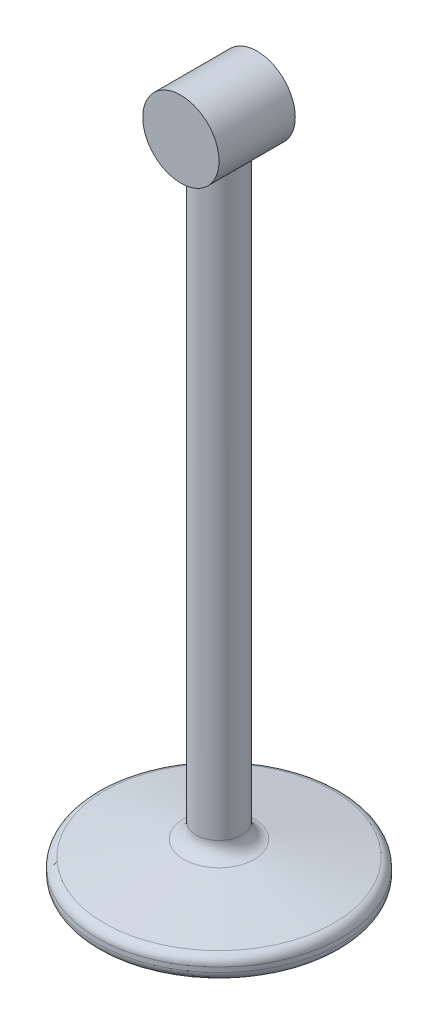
ISO-10303-21;
HEADER;
FILE_DESCRIPTION(('STEP AP214'),'2;1');
FILE_NAME('part.step','',(''),(''),'','','');
FILE_SCHEMA(('AUTOMOTIVE_DESIGN { 1 0 10303 214 1 1 1 1 }'));
ENDSEC;
DATA;
#1=APPLICATION_CONTEXT('core data for automotive mechanical design processes');
#2=APPLICATION_PROTOCOL_DEFINITION('international standard','automotive_design',2000,#1);
#3=PRODUCT_CONTEXT('',#1,'mechanical');
#4=PRODUCT('Part','Part','',(#3));
#5=PRODUCT_RELATED_PRODUCT_CATEGORY('part','',(#4));
#6=PRODUCT_DEFINITION_FORMATION('','',#4);
#7=PRODUCT_DEFINITION_CONTEXT('part definition',#1,'design');
#8=PRODUCT_DEFINITION('design','',#6,#7);
#9=PRODUCT_DEFINITION_SHAPE('','',#8);
#10=(LENGTH_UNIT() NAMED_UNIT(*) SI_UNIT(.MILLI.,.METRE.));
#11=(NAMED_UNIT(*) PLANE_ANGLE_UNIT() SI_UNIT($,.RADIAN.));
#12=(NAMED_UNIT(*) SI_UNIT($,.STERADIAN.) SOLID_ANGLE_UNIT());
#13=UNCERTAINTY_MEASURE_WITH_UNIT(LENGTH_MEASURE(1.E-05),#10,'distance_accuracy_value','');
#14=(GEOMETRIC_REPRESENTATION_CONTEXT(3) GLOBAL_UNCERTAINTY_ASSIGNED_CONTEXT((#13)) GLOBAL_UNIT_ASSIGNED_CONTEXT((#10,
#11,#12)) REPRESENTATION_CONTEXT('',''));
#15=CARTESIAN_POINT('',(0.,0.,0.));
#16=DIRECTION('',(0.,0.,1.));
#17=DIRECTION('',(1.,0.,0.));
#18=AXIS2_PLACEMENT_3D('',#15,#16,#17);
#19=CARTESIAN_POINT('',(0.,50.8,-3.175));
#20=DIRECTION('',(0.,0.,1.));
#21=DIRECTION('',(1.,0.,0.));
#22=AXIS2_PLACEMENT_3D('',#19,#20,#21);
#23=CYLINDRICAL_SURFACE('',#22,3.175);
#24=CARTESIAN_POINT('',(0.,50.8,3.175));
#25=DIRECTION('',(0.,0.,1.));
#26=DIRECTION('',(1.,0.,0.));
#27=AXIS2_PLACEMENT_3D('',#24,#25,#26);
#28=CIRCLE('',#27,3.175);
#29=CARTESIAN_POINT('',(3.175,50.8,3.175));
#30=VERTEX_POINT('',#29);
#31=EDGE_CURVE('E47',#30,#30,#28,.T.);
#32=ORIENTED_EDGE('',*,*,#31,.F.);
#33=EDGE_LOOP('',(#32));
#34=FACE_BOUND('',#33,.T.);
#35=CARTESIAN_POINT('',(0.,50.8,-3.175));
#36=DIRECTION('',(0.,0.,1.));
#37=DIRECTION('',(1.,0.,0.));
#38=AXIS2_PLACEMENT_3D('',#35,#36,#37);
#39=CIRCLE('',#38,3.175);
#40=CARTESIAN_POINT('',(3.175,50.8,-3.175));
#41=VERTEX_POINT('',#40);
#42=EDGE_CURVE('E43',#41,#41,#39,.T.);
#43=ORIENTED_EDGE('',*,*,#42,.T.);
#44=EDGE_LOOP('',(#43));
#45=FACE_BOUND('',#44,.T.);
#46=CARTESIAN_POINT('',(0.,47.625,-1.905));
#47=CARTESIAN_POINT('',(0.0974450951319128,47.6250054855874,-1.90499395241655));
#48=CARTESIAN_POINT('',(0.195049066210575,47.6295353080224,-1.89747035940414));
#49=CARTESIAN_POINT('',(0.387319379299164,47.6472260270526,-1.86775834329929));
#50=CARTESIAN_POINT('',(0.481977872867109,47.6604082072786,-1.84553375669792));
#51=CARTESIAN_POINT('',(0.665164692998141,47.6940682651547,-1.78766926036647));
#52=CARTESIAN_POINT('',(0.753720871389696,47.7145099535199,-1.75209584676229));
#53=CARTESIAN_POINT('',(0.923328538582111,47.7609488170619,-1.66895739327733));
#54=CARTESIAN_POINT('',(1.00438188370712,47.7869446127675,-1.62139533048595));
#55=CARTESIAN_POINT('',(1.16370007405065,47.8446419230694,-1.51158596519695));
#56=CARTESIAN_POINT('',(1.24127770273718,47.8766277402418,-1.44849380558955));
#57=CARTESIAN_POINT('',(1.3854210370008,47.9421134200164,-1.31131665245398));
#58=CARTESIAN_POINT('',(1.45197239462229,47.9756151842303,-1.23721757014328));
#59=CARTESIAN_POINT('',(1.5804514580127,48.0452294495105,-1.06943714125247));
#60=CARTESIAN_POINT('',(1.6408116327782,48.0811583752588,-0.97446875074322));
#61=CARTESIAN_POINT('',(1.74449025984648,48.1464835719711,-0.773624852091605));
#62=CARTESIAN_POINT('',(1.78783637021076,48.1758904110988,-0.667767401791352));
#63=CARTESIAN_POINT('',(1.84709564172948,48.217396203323,-0.474222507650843));
#64=CARTESIAN_POINT('',(1.86710570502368,48.2319598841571,-0.388320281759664));
#65=CARTESIAN_POINT('',(1.89504538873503,48.2525030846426,-0.213609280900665));
#66=CARTESIAN_POINT('',(1.90299002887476,48.258493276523,-0.124804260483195));
#67=CARTESIAN_POINT('',(1.90633996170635,48.2610042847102,0.0533545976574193));
#68=CARTESIAN_POINT('',(1.90172064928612,48.2575065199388,0.142709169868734));
#69=CARTESIAN_POINT('',(1.8801849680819,48.2415435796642,0.319124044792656));
#70=CARTESIAN_POINT('',(1.86325934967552,48.2290716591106,0.406182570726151));
#71=CARTESIAN_POINT('',(1.81830880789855,48.197094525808,0.574713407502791));
#72=CARTESIAN_POINT('',(1.79043010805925,48.1776822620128,0.656243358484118));
#73=CARTESIAN_POINT('',(1.72459728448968,48.1339264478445,0.813682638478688));
#74=CARTESIAN_POINT('',(1.68663946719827,48.109581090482,0.889589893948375));
#75=CARTESIAN_POINT('',(1.59407838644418,48.0535573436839,1.04772980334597));
#76=CARTESIAN_POINT('',(1.53772519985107,48.021341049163,1.12874817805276));
#77=CARTESIAN_POINT('',(1.41339687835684,47.9560813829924,1.28101913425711));
#78=CARTESIAN_POINT('',(1.34541063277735,47.9230372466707,1.35226226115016));
#79=CARTESIAN_POINT('',(1.18848102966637,47.8544190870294,1.49302848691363));
#80=CARTESIAN_POINT('',(1.0979374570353,47.8191342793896,1.56092817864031));
#81=CARTESIAN_POINT('',(0.904590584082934,47.7548901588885,1.68036499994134));
#82=CARTESIAN_POINT('',(0.801793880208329,47.725927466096,1.73191087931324));
#83=CARTESIAN_POINT('',(0.593340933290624,47.6792240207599,1.81347387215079));
#84=CARTESIAN_POINT('',(0.488273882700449,47.6608907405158,1.84464370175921));
#85=CARTESIAN_POINT('',(0.273110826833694,47.6349206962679,1.88850422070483));
#86=CARTESIAN_POINT('',(0.163021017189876,47.6272711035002,1.90121707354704));
#87=CARTESIAN_POINT('',(-0.0428175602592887,47.6238497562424,1.90691496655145));
#88=CARTESIAN_POINT('',(-0.138483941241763,47.6266062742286,1.90234424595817));
#89=CARTESIAN_POINT('',(-0.327443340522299,47.6405103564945,1.87905916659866));
#90=CARTESIAN_POINT('',(-0.420736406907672,47.6516577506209,1.86034509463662));
#91=CARTESIAN_POINT('',(-0.600170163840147,47.6809461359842,1.81032984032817));
#92=CARTESIAN_POINT('',(-0.6864296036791,47.6989104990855,1.77934575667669));
#93=CARTESIAN_POINT('',(-0.852507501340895,47.7403937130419,1.70601973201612));
#94=CARTESIAN_POINT('',(-0.932324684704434,47.7639136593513,1.66367555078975));
#95=CARTESIAN_POINT('',(-1.09220795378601,47.8174621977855,1.56393263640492));
#96=CARTESIAN_POINT('',(-1.17144057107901,47.8479129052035,1.50542773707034));
#97=CARTESIAN_POINT('',(-1.31956305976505,47.9110768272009,1.37745293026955));
#98=CARTESIAN_POINT('',(-1.38844071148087,47.9437926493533,1.30797026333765));
#99=CARTESIAN_POINT('',(-1.52313635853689,48.0130431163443,1.1494638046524));
#100=CARTESIAN_POINT('',(-1.58738594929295,48.0495198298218,1.05907346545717));
#101=CARTESIAN_POINT('',(-1.69983453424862,48.117554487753,0.867135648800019));
#102=CARTESIAN_POINT('',(-1.74805043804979,48.1491175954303,0.765600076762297));
#103=CARTESIAN_POINT('',(-1.81791075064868,48.1966916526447,0.576271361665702));
#104=CARTESIAN_POINT('',(-1.84304464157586,48.2145891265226,0.490245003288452));
#105=CARTESIAN_POINT('',(-1.88104353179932,48.2420980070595,0.314284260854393));
#106=CARTESIAN_POINT('',(-1.89392554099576,48.2517208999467,0.224355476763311));
#107=CARTESIAN_POINT('',(-1.90670345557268,48.2612643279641,0.0427012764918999));
#108=CARTESIAN_POINT('',(-1.90655052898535,48.2611483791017,-0.0490296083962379));
#109=CARTESIAN_POINT('',(-1.89314420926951,48.2511389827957,-0.231005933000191));
#110=CARTESIAN_POINT('',(-1.87988369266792,48.2412402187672,-0.321250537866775));
#111=CARTESIAN_POINT('',(-1.84201020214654,48.2138585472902,-0.493380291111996));
#112=CARTESIAN_POINT('',(-1.81797495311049,48.1967640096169,-0.575458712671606));
#113=CARTESIAN_POINT('',(-1.75975320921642,48.1570601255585,-0.734488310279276));
#114=CARTESIAN_POINT('',(-1.72556289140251,48.1344487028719,-0.811437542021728));
#115=CARTESIAN_POINT('',(-1.641973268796,48.0820350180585,-0.970686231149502));
#116=CARTESIAN_POINT('',(-1.59104483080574,48.0516617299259,-1.05199325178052));
#117=CARTESIAN_POINT('',(-1.47797196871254,47.9892343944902,-1.20571264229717));
#118=CARTESIAN_POINT('',(-1.41581830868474,47.957178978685,-1.2781176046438));
#119=CARTESIAN_POINT('',(-1.27012155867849,47.888833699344,-1.42411592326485));
#120=CARTESIAN_POINT('',(-1.18474305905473,47.8527069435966,-1.49597334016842));
#121=CARTESIAN_POINT('',(-1.00135779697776,47.7854591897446,-1.624453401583));
#122=CARTESIAN_POINT('',(-0.903346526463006,47.754339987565,-1.68107058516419));
#123=CARTESIAN_POINT('',(-0.699890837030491,47.7013826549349,-1.77519115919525));
#124=CARTESIAN_POINT('',(-0.594765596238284,47.6792896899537,-1.8132263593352));
#125=CARTESIAN_POINT('',(-0.432421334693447,47.65410483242,-1.85611954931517));
#126=CARTESIAN_POINT('',(-0.377590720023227,47.6470389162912,-1.86805220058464));
#127=CARTESIAN_POINT('',(-0.266820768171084,47.6357438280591,-1.88705550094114));
#128=CARTESIAN_POINT('',(-0.210882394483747,47.6315122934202,-1.8941301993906));
#129=CARTESIAN_POINT('',(-0.128982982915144,47.6275163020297,-1.90080377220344));
#130=CARTESIAN_POINT('',(-0.103222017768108,47.6265738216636,-1.90237615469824));
#131=CARTESIAN_POINT('',(-0.0516444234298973,47.6253149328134,-1.90447508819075));
#132=CARTESIAN_POINT('',(-0.0258277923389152,47.6249985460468,-1.90500160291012));
#133=CARTESIAN_POINT('',(0.,47.625,-1.905));
#134=B_SPLINE_CURVE_WITH_KNOTS('',3,(#46,#47,#48,#49,#50,#51,#52,#53,#54,#55,#56,#57,#58,#59,
#60,#61,#62,#63,#64,#65,#66,#67,#68,#69,#70,#71,#72,#73,#74,#75,#76,#77,#78,#79,#80,#81,#82,#83,
#84,#85,#86,#87,#88,#89,#90,#91,#92,#93,#94,#95,#96,#97,#98,#99,#100,#101,#102,#103,#104,#105,
#106,#107,#108,#109,#110,#111,#112,#113,#114,#115,#116,#117,#118,#119,#120,#121,#122,#123,#124,
#125,#126,#127,#128,#129,#130,#131,#132,#133),.UNSPECIFIED.,.T.,.F.,(4,2,2,2,2,2,2,2,2,2,2,2,2,
2,2,2,2,2,2,2,2,2,2,2,2,2,2,2,2,2,2,2,2,2,2,2,2,2,2,2,2,2,2,4),(0.,0.292229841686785,
0.585181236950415,0.876692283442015,1.16813101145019,1.4818562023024,1.79598647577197,
2.14863442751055,2.50070671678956,2.76775963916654,3.03447984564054,3.30172277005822,
3.56916676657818,3.83315549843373,4.09724110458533,4.40749683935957,4.71805056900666,
5.07188416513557,5.42552812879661,5.7568692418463,6.08781214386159,6.37382015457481,
6.65982236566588,6.9388708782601,7.21797445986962,7.52603734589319,7.83446096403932,
8.18307688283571,8.53132396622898,8.80437389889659,9.07704418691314,9.35073600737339,
9.6245766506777,9.88522404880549,10.1459696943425,10.446748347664,10.7477756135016,
11.0979497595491,11.4482492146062,11.787830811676,11.9572649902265,12.1265577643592,
12.2040105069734,12.2814659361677),.UNSPECIFIED.);
#135=CARTESIAN_POINT('',(0.,47.625,-1.905));
#136=VERTEX_POINT('',#135);
#137=EDGE_CURVE('E10',#136,#136,#134,.T.);
#138=ORIENTED_EDGE('',*,*,#137,.F.);
#139=EDGE_LOOP('',(#138));
#140=FACE_BOUND('',#139,.T.);
#141=ADVANCED_FACE('F33',(#34,#45,#140),#23,.T.);
#142=CARTESIAN_POINT('',(0.,50.8,-3.175));
#143=DIRECTION('',(0.,0.,1.));
#144=DIRECTION('',(1.,0.,0.));
#145=AXIS2_PLACEMENT_3D('',#142,#143,#144);
#146=PLANE('',#145);
#147=ORIENTED_EDGE('',*,*,#42,.F.);
#148=EDGE_LOOP('',(#147));
#149=FACE_BOUND('',#148,.T.);
#150=ADVANCED_FACE('F86',(#149),#146,.F.);
#151=CARTESIAN_POINT('',(0.,50.8,3.175));
#152=DIRECTION('',(0.,0.,1.));
#153=DIRECTION('',(1.,0.,0.));
#154=AXIS2_PLACEMENT_3D('',#151,#152,#153);
#155=PLANE('',#154);
#156=ORIENTED_EDGE('',*,*,#31,.T.);
#157=EDGE_LOOP('',(#156));
#158=FACE_BOUND('',#157,.T.);
#159=ADVANCED_FACE('F78',(#158),#155,.T.);
#160=CARTESIAN_POINT('',(0.,50.8,0.));
#161=DIRECTION('',(0.,-1.,0.));
#162=DIRECTION('',(0.,0.,-1.));
#163=AXIS2_PLACEMENT_3D('',#160,#161,#162);
#164=CYLINDRICAL_SURFACE('',#163,1.905);
#165=ORIENTED_EDGE('',*,*,#137,.T.);
#166=EDGE_LOOP('',(#165));
#167=FACE_BOUND('',#166,.T.);
#168=CARTESIAN_POINT('',(0.,0.,0.));
#169=DIRECTION('',(0.,-1.,0.));
#170=DIRECTION('',(0.,0.,-1.));
#171=AXIS2_PLACEMENT_3D('',#168,#169,#170);
#172=CIRCLE('',#171,1.905);
#173=CARTESIAN_POINT('',(0.,0.,-1.905));
#174=VERTEX_POINT('',#173);
#175=EDGE_CURVE('E69',#174,#174,#172,.T.);
#176=ORIENTED_EDGE('',*,*,#175,.F.);
#177=EDGE_LOOP('',(#176));
#178=FACE_BOUND('',#177,.T.);
#179=ADVANCED_FACE('F35',(#167,#178),#164,.T.);
#180=CARTESIAN_POINT('',(0.,-4.445,0.));
#181=DIRECTION('',(0.,-1.,0.));
#182=DIRECTION('',(0.,0.,-1.));
#183=AXIS2_PLACEMENT_3D('',#180,#181,#182);
#184=PLANE('',#183);
#185=CARTESIAN_POINT('',(0.,-4.445,0.));
#186=DIRECTION('',(0.,-1.,0.));
#187=DIRECTION('',(0.,0.,-1.));
#188=AXIS2_PLACEMENT_3D('',#185,#186,#187);
#189=CIRCLE('',#188,9.398);
#190=CARTESIAN_POINT('',(0.,-4.445,-9.398));
#191=VERTEX_POINT('',#190);
#192=EDGE_CURVE('E51',#191,#191,#189,.T.);
#193=ORIENTED_EDGE('',*,*,#192,.T.);
#194=EDGE_LOOP('',(#193));
#195=FACE_BOUND('',#194,.T.);
#196=ADVANCED_FACE('F77',(#195),#184,.T.);
#197=CARTESIAN_POINT('',(0.,-3.683,0.));
#198=DIRECTION('',(0.,-1.,0.));
#199=DIRECTION('',(0.,0.,-1.));
#200=AXIS2_PLACEMENT_3D('',#197,#198,#199);
#201=TOROIDAL_SURFACE('',#200,9.398,0.761999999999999);
#202=CARTESIAN_POINT('',(0.,-3.683,0.));
#203=DIRECTION('',(0.,-1.,0.));
#204=DIRECTION('',(0.,0.,-1.));
#205=AXIS2_PLACEMENT_3D('',#202,#203,#204);
#206=CIRCLE('',#205,10.16);
#207=CARTESIAN_POINT('',(0.,-3.683,-10.16));
#208=VERTEX_POINT('',#207);
#209=EDGE_CURVE('E56',#208,#208,#206,.T.);
#210=ORIENTED_EDGE('',*,*,#209,.T.);
#211=EDGE_LOOP('',(#210));
#212=FACE_BOUND('',#211,.T.);
#213=ORIENTED_EDGE('',*,*,#192,.F.);
#214=EDGE_LOOP('',(#213));
#215=FACE_BOUND('',#214,.T.);
#216=ADVANCED_FACE('F83',(#212,#215),#201,.T.);
#217=CARTESIAN_POINT('',(0.,-4.445,0.));
#218=DIRECTION('',(0.,-1.,0.));
#219=DIRECTION('',(0.,0.,-1.));
#220=AXIS2_PLACEMENT_3D('',#217,#218,#219);
#221=CYLINDRICAL_SURFACE('',#220,10.16);
#222=CARTESIAN_POINT('',(0.,-3.28782640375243,0.));
#223=DIRECTION('',(0.,-1.,0.));
#224=DIRECTION('',(0.,0.,-1.));
#225=AXIS2_PLACEMENT_3D('',#222,#223,#224);
#226=CIRCLE('',#225,10.16);
#227=CARTESIAN_POINT('',(0.,-3.28782640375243,-10.16));
#228=VERTEX_POINT('',#227);
#229=EDGE_CURVE('E59',#228,#228,#226,.T.);
#230=ORIENTED_EDGE('',*,*,#229,.T.);
#231=EDGE_LOOP('',(#230));
#232=FACE_BOUND('',#231,.T.);
#233=ORIENTED_EDGE('',*,*,#209,.F.);
#234=EDGE_LOOP('',(#233));
#235=FACE_BOUND('',#234,.T.);
#236=ADVANCED_FACE('F101',(#232,#235),#221,.T.);
#237=CARTESIAN_POINT('',(0.,-3.28782640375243,0.));
#238=DIRECTION('',(0.,-1.,0.));
#239=DIRECTION('',(0.,0.,-1.));
#240=AXIS2_PLACEMENT_3D('',#237,#238,#239);
#241=TOROIDAL_SURFACE('',#240,9.398,0.762);
#242=CARTESIAN_POINT('',(0.,-2.54,0.));
#243=DIRECTION('',(0.,-1.,0.));
#244=DIRECTION('',(0.,0.,-1.));
#245=AXIS2_PLACEMENT_3D('',#242,#243,#244);
#246=CIRCLE('',#245,9.54428625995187);
#247=CARTESIAN_POINT('',(0.,-2.54,-9.54428625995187));
#248=VERTEX_POINT('',#247);
#249=EDGE_CURVE('E63',#248,#248,#246,.T.);
#250=ORIENTED_EDGE('',*,*,#249,.T.);
#251=EDGE_LOOP('',(#250));
#252=FACE_BOUND('',#251,.T.);
#253=ORIENTED_EDGE('',*,*,#229,.F.);
#254=EDGE_LOOP('',(#253));
#255=FACE_BOUND('',#254,.T.);
#256=ADVANCED_FACE('F105',(#252,#255),#241,.T.);
#257=CARTESIAN_POINT('',(0.,-2.54,0.));
#258=DIRECTION('',(0.,-1.,0.));
#259=DIRECTION('',(0.,0.,-1.));
#260=AXIS2_PLACEMENT_3D('',#257,#258,#259);
#261=CONICAL_SURFACE('',#260,9.54428625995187,1.37762039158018);
#262=CARTESIAN_POINT('',(0.,-1.24637733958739,0.));
#263=DIRECTION('',(0.,-1.,0.));
#264=DIRECTION('',(0.,0.,-1.));
#265=AXIS2_PLACEMENT_3D('',#262,#263,#264);
#266=CIRCLE('',#265,2.93118956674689);
#267=CARTESIAN_POINT('',(0.,-1.24637733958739,-2.93118956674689));
#268=VERTEX_POINT('',#267);
#269=EDGE_CURVE('E66',#268,#268,#266,.T.);
#270=CARTESIAN_POINT('',(0.,-1.24637733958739,-2.93118956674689));
#271=CARTESIAN_POINT('',(0.,-1.25985257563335,-3.00007599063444));
#272=CARTESIAN_POINT('',(0.,-1.27332781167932,-3.06896241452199));
#273=CARTESIAN_POINT('',(0.,-1.30027828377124,-3.2067352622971));
#274=CARTESIAN_POINT('',(0.,-1.31375351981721,-3.27562168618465));
#275=CARTESIAN_POINT('',(0.,-1.34070399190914,-3.41339453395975));
#276=CARTESIAN_POINT('',(0.,-1.3541792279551,-3.4822809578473));
#277=CARTESIAN_POINT('',(0.,-1.38112970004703,-3.62005380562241));
#278=CARTESIAN_POINT('',(0.,-1.394604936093,-3.68894022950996));
#279=CARTESIAN_POINT('',(0.,-1.42155540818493,-3.82671307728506));
#280=CARTESIAN_POINT('',(0.,-1.43503064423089,-3.89559950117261));
#281=CARTESIAN_POINT('',(0.,-1.46198111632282,-4.03337234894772));
#282=CARTESIAN_POINT('',(0.,-1.47545635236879,-4.10225877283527));
#283=CARTESIAN_POINT('',(0.,-1.50240682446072,-4.24003162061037));
#284=CARTESIAN_POINT('',(0.,-1.51588206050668,-4.30891804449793));
#285=CARTESIAN_POINT('',(0.,-1.54283253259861,-4.44669089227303));
#286=CARTESIAN_POINT('',(0.,-1.55630776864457,-4.51557731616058));
#287=CARTESIAN_POINT('',(0.,-1.5832582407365,-4.65335016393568));
#288=CARTESIAN_POINT('',(0.,-1.59673347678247,-4.72223658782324));
#289=CARTESIAN_POINT('',(0.,-1.6236839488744,-4.86000943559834));
#290=CARTESIAN_POINT('',(0.,-1.63715918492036,-4.92889585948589));
#291=CARTESIAN_POINT('',(0.,-1.66410965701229,-5.066668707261));
#292=CARTESIAN_POINT('',(0.,-1.67758489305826,-5.13555513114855));
#293=CARTESIAN_POINT('',(0.,-1.70453536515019,-5.27332797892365));
#294=CARTESIAN_POINT('',(0.,-1.71801060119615,-5.3422144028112));
#295=CARTESIAN_POINT('',(0.,-1.74496107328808,-5.47998725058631));
#296=CARTESIAN_POINT('',(0.,-1.75843630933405,-5.54887367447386));
#297=CARTESIAN_POINT('',(0.,-1.78538678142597,-5.68664652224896));
#298=CARTESIAN_POINT('',(0.,-1.79886201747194,-5.75553294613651));
#299=CARTESIAN_POINT('',(0.,-1.82581248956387,-5.89330579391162));
#300=CARTESIAN_POINT('',(0.,-1.83928772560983,-5.96219221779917));
#301=CARTESIAN_POINT('',(0.,-1.86623819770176,-6.09996506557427));
#302=CARTESIAN_POINT('',(0.,-1.87971343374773,-6.16885148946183));
#303=CARTESIAN_POINT('',(0.,-1.90666390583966,-6.30662433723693));
#304=CARTESIAN_POINT('',(0.,-1.92013914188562,-6.37551076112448));
#305=CARTESIAN_POINT('',(0.,-1.94708961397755,-6.51328360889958));
#306=CARTESIAN_POINT('',(0.,-1.96056485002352,-6.58217003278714));
#307=CARTESIAN_POINT('',(0.,-1.98751532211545,-6.71994288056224));
#308=CARTESIAN_POINT('',(0.,-2.00099055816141,-6.78882930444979));
#309=CARTESIAN_POINT('',(0.,-2.02794103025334,-6.9266021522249));
#310=CARTESIAN_POINT('',(0.,-2.0414162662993,-6.99548857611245));
#311=CARTESIAN_POINT('',(0.,-2.06836673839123,-7.13326142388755));
#312=CARTESIAN_POINT('',(0.,-2.0818419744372,-7.2021478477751));
#313=CARTESIAN_POINT('',(0.,-2.10879244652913,-7.33992069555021));
#314=CARTESIAN_POINT('',(0.,-2.12226768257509,-7.40880711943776));
#315=CARTESIAN_POINT('',(0.,-2.14921815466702,-7.54657996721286));
#316=CARTESIAN_POINT('',(0.,-2.16269339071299,-7.61546639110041));
#317=CARTESIAN_POINT('',(0.,-2.18964386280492,-7.75323923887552));
#318=CARTESIAN_POINT('',(0.,-2.20311909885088,-7.82212566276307));
#319=CARTESIAN_POINT('',(0.,-2.23006957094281,-7.95989851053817));
#320=CARTESIAN_POINT('',(0.,-2.24354480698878,-8.02878493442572));
#321=CARTESIAN_POINT('',(0.,-2.2704952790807,-8.16655778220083));
#322=CARTESIAN_POINT('',(0.,-2.28397051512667,-8.23544420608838));
#323=CARTESIAN_POINT('',(0.,-2.3109209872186,-8.37321705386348));
#324=CARTESIAN_POINT('',(0.,-2.32439622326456,-8.44210347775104));
#325=CARTESIAN_POINT('',(0.,-2.35134669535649,-8.57987632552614));
#326=CARTESIAN_POINT('',(0.,-2.36482193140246,-8.64876274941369));
#327=CARTESIAN_POINT('',(0.,-2.39177240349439,-8.7865355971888));
#328=CARTESIAN_POINT('',(0.,-2.40524763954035,-8.85542202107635));
#329=CARTESIAN_POINT('',(0.,-2.43219811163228,-8.99319486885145));
#330=CARTESIAN_POINT('',(0.,-2.44567334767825,-9.062081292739));
#331=CARTESIAN_POINT('',(0.,-2.47262381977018,-9.19985414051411));
#332=CARTESIAN_POINT('',(0.,-2.48609905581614,-9.26874056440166));
#333=CARTESIAN_POINT('',(0.,-2.51304952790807,-9.40651341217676));
#334=CARTESIAN_POINT('',(0.,-2.52652476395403,-9.47539983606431));
#335=CARTESIAN_POINT('',(0.,-2.54,-9.54428625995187));
#336=B_SPLINE_CURVE_WITH_KNOTS('',3,(#270,#271,#272,#273,#274,#275,#276,#277,#278,#279,#280,
#281,#282,#283,#284,#285,#286,#287,#288,#289,#290,#291,#292,#293,#294,#295,#296,#297,#298,#299,
#300,#301,#302,#303,#304,#305,#306,#307,#308,#309,#310,#311,#312,#313,#314,#315,#316,#317,#318,
#319,#320,#321,#322,#323,#324,#325,#326,#327,#328,#329,#330,#331,#332,#333,#334,#335),
.UNSPECIFIED.,.F.,.F.,(4,2,2,2,2,2,2,2,2,2,2,2,2,2,2,2,2,2,2,2,2,2,2,2,2,2,2,2,2,2,2,2,4),(0.,
0.21057609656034,0.421152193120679,0.631728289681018,0.842304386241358,1.0528804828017,
1.26345657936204,1.47403267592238,1.68460877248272,1.89518486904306,2.1057609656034,
2.31633706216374,2.52691315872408,2.73748925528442,2.94806535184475,3.15864144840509,
3.36921754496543,3.57979364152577,3.79036973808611,4.00094583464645,4.21152193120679,
4.42209802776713,4.63267412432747,4.84325022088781,5.05382631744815,5.26440241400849,
5.47497851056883,5.68555460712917,5.89613070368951,6.10670680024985,6.31728289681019,
6.52785899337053,6.73843508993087),.UNSPECIFIED.);
#337=EDGE_CURVE('BSEAM109',#268,#248,#336,.T.);
#338=ORIENTED_EDGE('',*,*,#269,.T.);
#339=ORIENTED_EDGE('',*,*,#249,.F.);
#340=ORIENTED_EDGE('',*,*,#337,.T.);
#341=ORIENTED_EDGE('',*,*,#337,.F.);
#342=EDGE_LOOP('',(#338,#340,#339,#341));
#343=FACE_BOUND('',#342,.T.);
#344=ADVANCED_FACE('F109',(#343),#261,.T.);
#345=CARTESIAN_POINT('',(0.,0.,0.));
#346=DIRECTION('',(0.,-1.,0.));
#347=DIRECTION('',(0.,0.,-1.));
#348=AXIS2_PLACEMENT_3D('',#345,#346,#347);
#349=TOROIDAL_SURFACE('',#348,3.175,1.27);
#350=ORIENTED_EDGE('',*,*,#175,.T.);
#351=EDGE_LOOP('',(#350));
#352=FACE_BOUND('',#351,.T.);
#353=ORIENTED_EDGE('',*,*,#269,.F.);
#354=EDGE_LOOP('',(#353));
#355=FACE_BOUND('',#354,.T.);
#356=ADVANCED_FACE('F73',(#352,#355),#349,.F.);
#357=CLOSED_SHELL('',(#141,#150,#159,#179,#196,#216,#236,#256,#344,#356));
#358=MANIFOLD_SOLID_BREP('B2',#357);
#359=ADVANCED_BREP_SHAPE_REPRESENTATION('',(#18,#358),#14);
#360=SHAPE_DEFINITION_REPRESENTATION(#9,#359);
ENDSEC;
END-ISO-10303-21;
